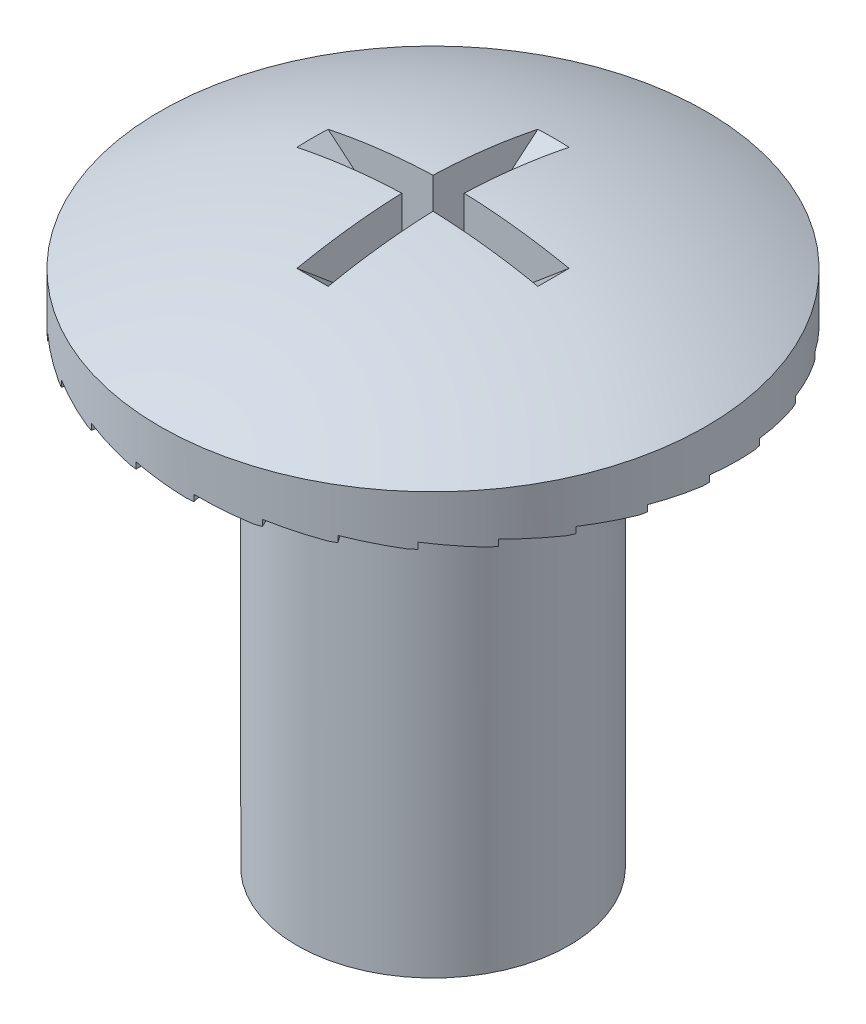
from build123d import *

# Parameters (mm, degrees)
F_8_CLEARANCE_HOLE1_D     = 4.4958
F_8_CLEARANCE_HOLE1_DEPTH = 6.35
F_8_CLEARANCE_HOLE1_TIP   = 1.350674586
CUT_EXTRUDE2_DEPTH        = 0.3175
CIRPATTERN1_COUNT         = 4
CUT_EXTRUDE4_REACH        = 19.215
CUT_EXTRUDE4_END_RADIUS   = 2.7686
CIRPATTERN2_COUNT         = 30


with BuildPart() as part:
    # Sketch1 → Revolve1 (revolve)
    with BuildSketch(Plane.XY, mode=Mode.PRIVATE) as revolve1_sk:
        with BuildLine():
            Line((5.55625, -1.3462), (5.55625, -2.3622))
            Line((5.55625, -2.3622), (2.7686, -2.3622))
            Line((2.7686, -2.3622), (2.7686, -11.8872))
            Line((2.7686, -11.8872), (0, -11.8872))
            Line((0, -11.8872), (0, 0))
            ThreePointArc((0, 0), (2.85485983, -0.356387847), (5.55625, -1.3462))
        make_face()
    revolve(revolve1_sk.sketch.rotate(Axis((0, 0, 0), (0, -1, 0)), 90), axis=Axis((0, 0, 0), (0, -1, 0)))

    # 8 Clearance Hole1
    with Locations(Plane.XZ.offset(11.8872)):
        with Locations((0, 0)):
            Hole(F_8_CLEARANCE_HOLE1_D / 2, depth=F_8_CLEARANCE_HOLE1_DEPTH)
            with Locations((0, 0, -(F_8_CLEARANCE_HOLE1_DEPTH + F_8_CLEARANCE_HOLE1_TIP / 2))):  # 118° drill point
                Cone(0, F_8_CLEARANCE_HOLE1_D / 2, F_8_CLEARANCE_HOLE1_TIP, mode=Mode.SUBTRACT)

    # Sketch5 → Cut-Extrude2 (cut, symmetric)
    with BuildSketch(Plane.XY):
        Polygon((0, -1.88938027), (0.52147216, -1.88938027), (2.802607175, 0.02471928), (0, 0.02471928), align=None)
    cut_extrude2 = extrude(amount=CUT_EXTRUDE2_DEPTH, both=True, mode=Mode.SUBTRACT)

    # CirPattern1: Cut-Extrude2 ×4 about axis
    cirpattern1_axis = Axis((0, 0, 0), (0, 1, 0))
    for i in range(1, CIRPATTERN1_COUNT):
        add(cut_extrude2.rotate(cirpattern1_axis, i * 360 / CIRPATTERN1_COUNT), mode=Mode.SUBTRACT)

    # Cut-Extrude4: up to this cylinder (the profile starts outside it)
    cut_extrude4_end = Plane(origin=(0, -2.319867, 0), z_dir=(0, 1, 0)) * Cylinder(CUT_EXTRUDE4_END_RADIUS, 44.9672, mode=Mode.PRIVATE)
    # Sketch8 → Cut-Extrude4 (cut, up to the surface)
    with BuildSketch(Plane.XY.offset(5.588), mode=Mode.PRIVATE) as cut_extrude4_sk1:
        Polygon((0.508, -2.3622), (-0.508, -2.2352), (-0.508, -2.3622), align=None)
    cut_extrude4_tool1 = extrude(cut_extrude4_sk1.sketch, amount=-CUT_EXTRUDE4_REACH, mode=Mode.PRIVATE) - cut_extrude4_end
    cut_extrude4 = cut_extrude4_tool1.solids().sort_by_distance((-0.169333, -2.319867, 5.588))[0]
    add(cut_extrude4, mode=Mode.SUBTRACT)

    # CirPattern2: Cut-Extrude4 ×30 about axis
    cirpattern2_axis = Axis((0, 0, 0), (0, 1, 0))
    for i in range(1, CIRPATTERN2_COUNT):
        add(cut_extrude4.rotate(cirpattern2_axis, i * 360 / CIRPATTERN2_COUNT), mode=Mode.SUBTRACT)


solid = part.part
